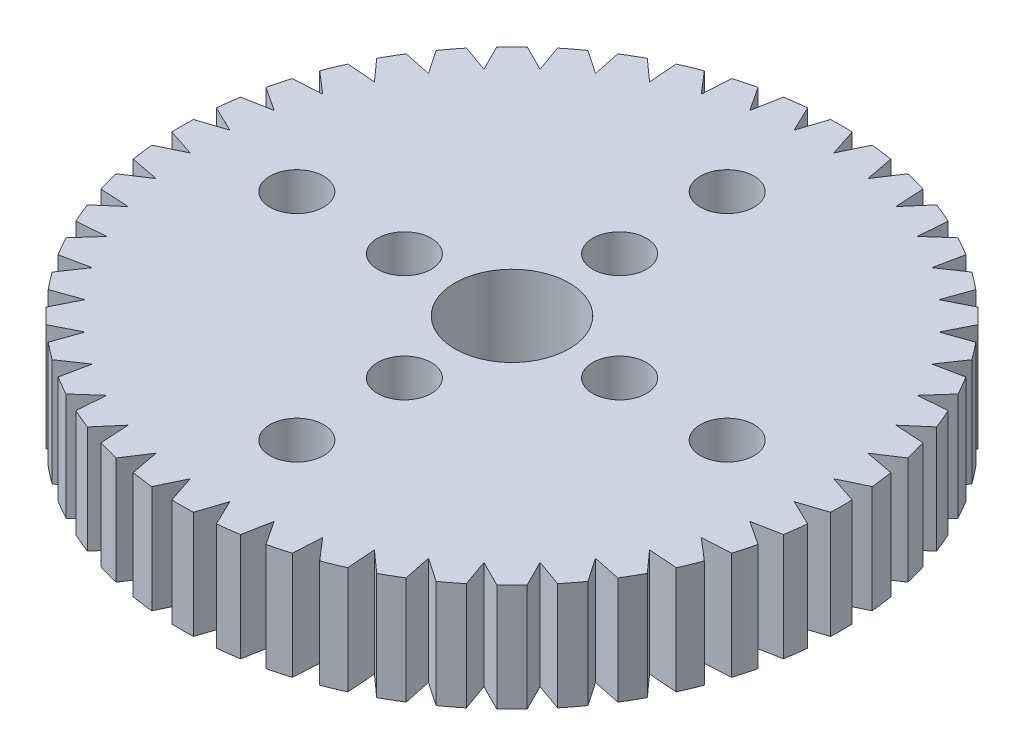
from build123d import *

# Parameters (mm, degrees)
EXTRUDE_1_DEPTH          = 8
PATTERN_CIRCULAR_1_COUNT = 48
SKETCH_2_R               = 4.25
CUT_EXTRUDE_2_DEPTH      = 13
SKETCH_3_R               = 2
CUT_EXTRUDE_3_DEPTH      = 13


with BuildPart() as part:
    # Sketch 1 → Extrude 1 (new body)
    with BuildSketch(Plane(origin=(0, 0, 0), x_dir=(1, 0, 0), z_dir=(0, 1, 0))):
        with BuildLine():
            Line((2.401419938, 24.382025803), (1.471570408, 22.451825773))
            ThreePointArc((1.471570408, 22.451825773), (-22.285896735, 2.933993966), (-4.389532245, -22.067668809))
            ThreePointArc((-4.389532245, -22.067668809), (22.067668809, -4.389532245), (4.389532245, 22.067668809))
            Line((4.389532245, 22.067668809), (3.990939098, 24.172761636))
            ThreePointArc((3.990939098, 24.172761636), (3.197891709, 24.290399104), (2.401419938, 24.382025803))
        make_face()
    extrude_1 = extrude(amount=EXTRUDE_1_DEPTH)

    # Pattern Circular 1: Extrude 1 ×48 about axis
    pattern_circular_1_axis = Axis((0, 0, 0), (0, 1, 0))
    for i in range(1, PATTERN_CIRCULAR_1_COUNT):
        add(extrude_1.rotate(pattern_circular_1_axis, i * 360 / PATTERN_CIRCULAR_1_COUNT))

    # Sketch 2 → Cut-Extrude 2 (cut)
    with BuildSketch(Plane(origin=(0, 0, 0), x_dir=(1, 0, 0), z_dir=(0, 1, 0))):
        with Locations(Location((0, 0, 0), (0, 0, 270))):
            Circle(SKETCH_2_R)
    extrude(amount=CUT_EXTRUDE_2_DEPTH, mode=Mode.SUBTRACT)

    # Sketch 3 → Cut-Extrude 3 (cut)
    with BuildSketch(Plane(origin=(0, 0, 0), x_dir=(-1, 0, 0), z_dir=(0, -1, 0))):
        with Locations(Location((8, 0, 0), (0, 0, 90))):
            Circle(SKETCH_3_R)
        Circle(SKETCH_3_R)
        with Locations(Location((16, 0, 0), (0, 0, 90))):
            Circle(SKETCH_3_R)
        with Locations(Location((-8, 0, 0), (0, 0, 90))):
            Circle(SKETCH_3_R)
        with Locations(Location((-16, 0, 0), (0, 0, 90))):
            Circle(SKETCH_3_R)
        with Locations(Location((0, 8, 0), (0, 0, 90))):
            Circle(SKETCH_3_R)
        with Locations(Location((0, 16, 0), (0, 0, 90))):
            Circle(SKETCH_3_R)
        with Locations(Location((0, -16, 0), (0, 0, 90))):
            Circle(SKETCH_3_R)
        with Locations(Location((0, -8, 0), (0, 0, 90))):
            Circle(SKETCH_3_R)
    extrude(amount=-CUT_EXTRUDE_3_DEPTH, mode=Mode.SUBTRACT)


solid = part.part
